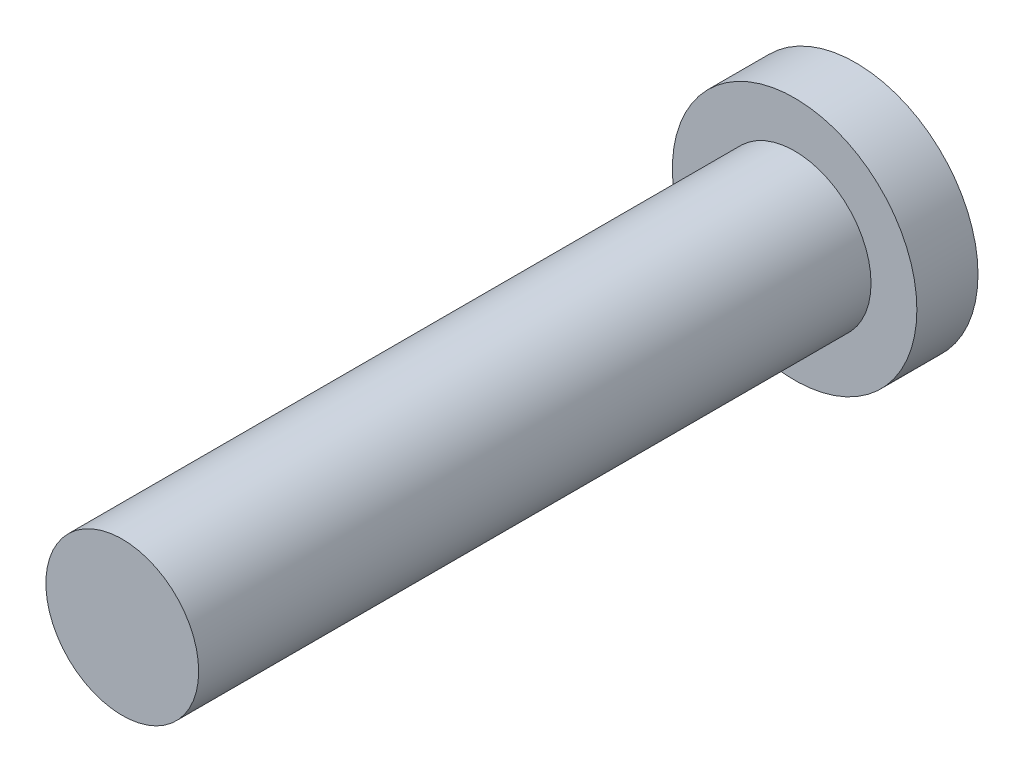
ISO-10303-21;
HEADER;
FILE_DESCRIPTION(('STEP AP214'),'2;1');
FILE_NAME('part.step','',(''),(''),'','','');
FILE_SCHEMA(('AUTOMOTIVE_DESIGN { 1 0 10303 214 1 1 1 1 }'));
ENDSEC;
DATA;
#1=APPLICATION_CONTEXT('core data for automotive mechanical design processes');
#2=APPLICATION_PROTOCOL_DEFINITION('international standard','automotive_design',2000,#1);
#3=PRODUCT_CONTEXT('',#1,'mechanical');
#4=PRODUCT('Part','Part','',(#3));
#5=PRODUCT_RELATED_PRODUCT_CATEGORY('part','',(#4));
#6=PRODUCT_DEFINITION_FORMATION('','',#4);
#7=PRODUCT_DEFINITION_CONTEXT('part definition',#1,'design');
#8=PRODUCT_DEFINITION('design','',#6,#7);
#9=PRODUCT_DEFINITION_SHAPE('','',#8);
#10=(LENGTH_UNIT() NAMED_UNIT(*) SI_UNIT(.MILLI.,.METRE.));
#11=(NAMED_UNIT(*) PLANE_ANGLE_UNIT() SI_UNIT($,.RADIAN.));
#12=(NAMED_UNIT(*) SI_UNIT($,.STERADIAN.) SOLID_ANGLE_UNIT());
#13=UNCERTAINTY_MEASURE_WITH_UNIT(LENGTH_MEASURE(1.E-05),#10,'distance_accuracy_value','');
#14=(GEOMETRIC_REPRESENTATION_CONTEXT(3) GLOBAL_UNCERTAINTY_ASSIGNED_CONTEXT((#13)) GLOBAL_UNIT_ASSIGNED_CONTEXT((#10,
#11,#12)) REPRESENTATION_CONTEXT('',''));
#15=CARTESIAN_POINT('',(0.,0.,0.));
#16=DIRECTION('',(0.,0.,1.));
#17=DIRECTION('',(1.,0.,0.));
#18=AXIS2_PLACEMENT_3D('',#15,#16,#17);
#19=CARTESIAN_POINT('',(0.,0.,0.999999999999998));
#20=DIRECTION('',(0.,0.,1.));
#21=DIRECTION('',(1.,0.,0.));
#22=AXIS2_PLACEMENT_3D('',#19,#20,#21);
#23=PLANE('',#22);
#24=CARTESIAN_POINT('',(0.,0.,0.999999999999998));
#25=DIRECTION('',(0.,0.,1.));
#26=DIRECTION('',(1.,0.,0.));
#27=AXIS2_PLACEMENT_3D('',#24,#25,#26);
#28=CIRCLE('',#27,2.);
#29=CARTESIAN_POINT('',(2.,0.,0.999999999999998));
#30=VERTEX_POINT('',#29);
#31=EDGE_CURVE('E10',#30,#30,#28,.T.);
#32=ORIENTED_EDGE('',*,*,#31,.T.);
#33=EDGE_LOOP('',(#32));
#34=FACE_BOUND('',#33,.T.);
#35=CARTESIAN_POINT('',(0.,0.,0.999999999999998));
#36=DIRECTION('',(0.,0.,1.));
#37=DIRECTION('',(1.,0.,0.));
#38=AXIS2_PLACEMENT_3D('',#35,#36,#37);
#39=CIRCLE('',#38,1.25);
#40=CARTESIAN_POINT('',(1.25,0.,0.999999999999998));
#41=VERTEX_POINT('',#40);
#42=EDGE_CURVE('E361',#41,#41,#39,.T.);
#43=ORIENTED_EDGE('',*,*,#42,.F.);
#44=EDGE_LOOP('',(#43));
#45=FACE_BOUND('',#44,.T.);
#46=ADVANCED_FACE('F346',(#34,#45),#23,.T.);
#47=CARTESIAN_POINT('',(0.,0.,0.999999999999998));
#48=DIRECTION('',(0.,0.,-1.));
#49=DIRECTION('',(-1.,0.,0.));
#50=AXIS2_PLACEMENT_3D('',#47,#48,#49);
#51=CYLINDRICAL_SURFACE('',#50,2.);
#52=ORIENTED_EDGE('',*,*,#31,.F.);
#53=EDGE_LOOP('',(#52));
#54=FACE_BOUND('',#53,.T.);
#55=CARTESIAN_POINT('',(0.,0.,0.));
#56=DIRECTION('',(0.,0.,1.));
#57=DIRECTION('',(1.,0.,0.));
#58=AXIS2_PLACEMENT_3D('',#55,#56,#57);
#59=CIRCLE('',#58,2.);
#60=CARTESIAN_POINT('',(2.,0.,0.));
#61=VERTEX_POINT('',#60);
#62=EDGE_CURVE('E353',#61,#61,#59,.T.);
#63=ORIENTED_EDGE('',*,*,#62,.T.);
#64=EDGE_LOOP('',(#63));
#65=FACE_BOUND('',#64,.T.);
#66=ADVANCED_FACE('F348',(#54,#65),#51,.T.);
#67=CARTESIAN_POINT('',(0.,0.,0.));
#68=DIRECTION('',(0.,0.,1.));
#69=DIRECTION('',(1.,0.,0.));
#70=AXIS2_PLACEMENT_3D('',#67,#68,#69);
#71=PLANE('',#70);
#72=ORIENTED_EDGE('',*,*,#62,.F.);
#73=EDGE_LOOP('',(#72));
#74=FACE_BOUND('',#73,.T.);
#75=ADVANCED_FACE('F375',(#74),#71,.F.);
#76=CARTESIAN_POINT('',(0.,0.,12.));
#77=DIRECTION('',(0.,0.,-1.));
#78=DIRECTION('',(-1.,0.,0.));
#79=AXIS2_PLACEMENT_3D('',#76,#77,#78);
#80=CYLINDRICAL_SURFACE('',#79,1.25);
#81=CARTESIAN_POINT('',(0.,0.,12.));
#82=DIRECTION('',(0.,0.,1.));
#83=DIRECTION('',(1.,0.,0.));
#84=AXIS2_PLACEMENT_3D('',#81,#82,#83);
#85=CIRCLE('',#84,1.25);
#86=CARTESIAN_POINT('',(1.25,0.,12.));
#87=VERTEX_POINT('',#86);
#88=EDGE_CURVE('E357',#87,#87,#85,.T.);
#89=ORIENTED_EDGE('',*,*,#88,.F.);
#90=EDGE_LOOP('',(#89));
#91=FACE_BOUND('',#90,.T.);
#92=ORIENTED_EDGE('',*,*,#42,.T.);
#93=EDGE_LOOP('',(#92));
#94=FACE_BOUND('',#93,.T.);
#95=ADVANCED_FACE('F367',(#91,#94),#80,.T.);
#96=CARTESIAN_POINT('',(0.,0.,12.));
#97=DIRECTION('',(0.,0.,1.));
#98=DIRECTION('',(1.,0.,0.));
#99=AXIS2_PLACEMENT_3D('',#96,#97,#98);
#100=PLANE('',#99);
#101=ORIENTED_EDGE('',*,*,#88,.T.);
#102=EDGE_LOOP('',(#101));
#103=FACE_BOUND('',#102,.T.);
#104=ADVANCED_FACE('F381',(#103),#100,.T.);
#105=CLOSED_SHELL('',(#46,#66,#75,#95,#104));
#106=MANIFOLD_SOLID_BREP('B2',#105);
#107=ADVANCED_BREP_SHAPE_REPRESENTATION('',(#18,#106),#14);
#108=SHAPE_DEFINITION_REPRESENTATION(#9,#107);
ENDSEC;
END-ISO-10303-21;
